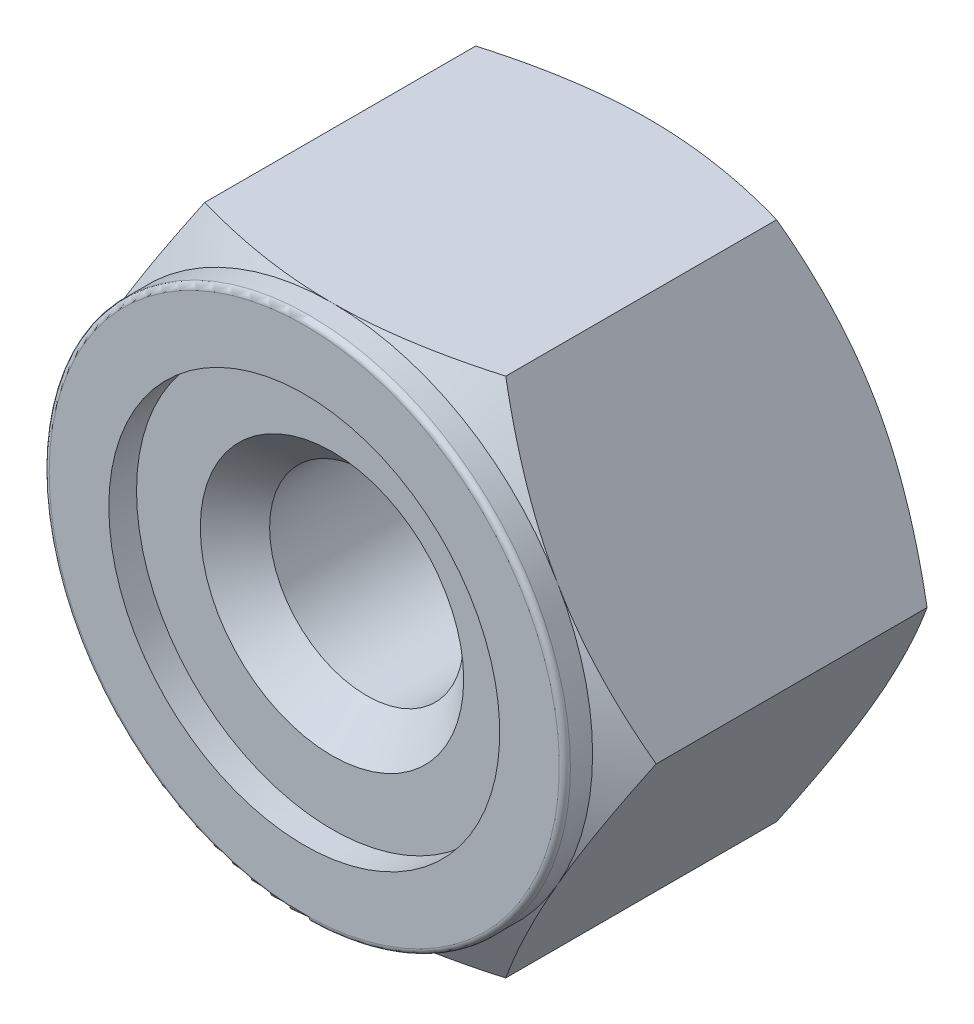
ISO-10303-21;
HEADER;
FILE_DESCRIPTION(('STEP AP214'),'2;1');
FILE_NAME('part.step','',(''),(''),'','','');
FILE_SCHEMA(('AUTOMOTIVE_DESIGN { 1 0 10303 214 1 1 1 1 }'));
ENDSEC;
DATA;
#1=APPLICATION_CONTEXT('core data for automotive mechanical design processes');
#2=APPLICATION_PROTOCOL_DEFINITION('international standard','automotive_design',2000,#1);
#3=PRODUCT_CONTEXT('',#1,'mechanical');
#4=PRODUCT('Part','Part','',(#3));
#5=PRODUCT_RELATED_PRODUCT_CATEGORY('part','',(#4));
#6=PRODUCT_DEFINITION_FORMATION('','',#4);
#7=PRODUCT_DEFINITION_CONTEXT('part definition',#1,'design');
#8=PRODUCT_DEFINITION('design','',#6,#7);
#9=PRODUCT_DEFINITION_SHAPE('','',#8);
#10=(LENGTH_UNIT() NAMED_UNIT(*) SI_UNIT(.MILLI.,.METRE.));
#11=(NAMED_UNIT(*) PLANE_ANGLE_UNIT() SI_UNIT($,.RADIAN.));
#12=(NAMED_UNIT(*) SI_UNIT($,.STERADIAN.) SOLID_ANGLE_UNIT());
#13=UNCERTAINTY_MEASURE_WITH_UNIT(LENGTH_MEASURE(1.E-05),#10,'distance_accuracy_value','');
#14=(GEOMETRIC_REPRESENTATION_CONTEXT(3) GLOBAL_UNCERTAINTY_ASSIGNED_CONTEXT((#13)) GLOBAL_UNIT_ASSIGNED_CONTEXT((#10,
#11,#12)) REPRESENTATION_CONTEXT('',''));
#15=CARTESIAN_POINT('',(0.,0.,0.));
#16=DIRECTION('',(0.,0.,1.));
#17=DIRECTION('',(1.,0.,0.));
#18=AXIS2_PLACEMENT_3D('',#15,#16,#17);
#19=CARTESIAN_POINT('',(0.,0.,-2.9083));
#20=DIRECTION('',(0.,0.,-1.));
#21=DIRECTION('',(-1.,0.,0.));
#22=AXIS2_PLACEMENT_3D('',#19,#20,#21);
#23=CONICAL_SURFACE('',#22,2.413,0.785398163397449);
#24=CARTESIAN_POINT('',(0.,0.,-2.9083));
#25=DIRECTION('',(0.,0.,1.));
#26=DIRECTION('',(1.,0.,0.));
#27=AXIS2_PLACEMENT_3D('',#24,#25,#26);
#28=CIRCLE('',#27,2.413);
#29=CARTESIAN_POINT('',(2.413,0.,-2.9083));
#30=VERTEX_POINT('',#29);
#31=EDGE_CURVE('E223',#30,#30,#28,.T.);
#32=ORIENTED_EDGE('',*,*,#31,.F.);
#33=EDGE_LOOP('',(#32));
#34=FACE_BOUND('',#33,.T.);
#35=CARTESIAN_POINT('',(0.,0.,-2.2733));
#36=DIRECTION('',(0.,0.,-1.));
#37=DIRECTION('',(1.,0.,0.));
#38=AXIS2_PLACEMENT_3D('',#35,#36,#37);
#39=CIRCLE('',#38,1.778);
#40=CARTESIAN_POINT('',(1.778,0.,-2.2733));
#41=VERTEX_POINT('',#40);
#42=EDGE_CURVE('E221',#41,#41,#39,.T.);
#43=ORIENTED_EDGE('',*,*,#42,.F.);
#44=EDGE_LOOP('',(#43));
#45=FACE_BOUND('',#44,.T.);
#46=ADVANCED_FACE('F17',(#34,#45),#23,.F.);
#47=CARTESIAN_POINT('',(0.,0.,2.2733));
#48=DIRECTION('',(0.,0.,1.));
#49=DIRECTION('',(1.,0.,0.));
#50=AXIS2_PLACEMENT_3D('',#47,#48,#49);
#51=CONICAL_SURFACE('',#50,1.778,0.785398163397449);
#52=CARTESIAN_POINT('',(0.,0.,2.2733));
#53=DIRECTION('',(0.,0.,1.));
#54=DIRECTION('',(1.,0.,0.));
#55=AXIS2_PLACEMENT_3D('',#52,#53,#54);
#56=CIRCLE('',#55,1.778);
#57=CARTESIAN_POINT('',(1.778,0.,2.2733));
#58=VERTEX_POINT('',#57);
#59=EDGE_CURVE('E218',#58,#58,#56,.T.);
#60=ORIENTED_EDGE('',*,*,#59,.F.);
#61=EDGE_LOOP('',(#60));
#62=FACE_BOUND('',#61,.T.);
#63=CARTESIAN_POINT('',(0.,0.,2.9083));
#64=DIRECTION('',(0.,0.,-1.));
#65=DIRECTION('',(1.,0.,0.));
#66=AXIS2_PLACEMENT_3D('',#63,#64,#65);
#67=CIRCLE('',#66,2.413);
#68=CARTESIAN_POINT('',(2.413,0.,2.9083));
#69=VERTEX_POINT('',#68);
#70=EDGE_CURVE('E232',#69,#69,#67,.T.);
#71=ORIENTED_EDGE('',*,*,#70,.F.);
#72=EDGE_LOOP('',(#71));
#73=FACE_BOUND('',#72,.T.);
#74=ADVANCED_FACE('F512',(#62,#73),#51,.F.);
#75=CARTESIAN_POINT('',(0.,0.,2.73018351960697));
#76=DIRECTION('',(0.,0.,-1.));
#77=DIRECTION('',(-1.,0.,0.));
#78=AXIS2_PLACEMENT_3D('',#75,#76,#77);
#79=CYLINDRICAL_SURFACE('',#78,3.5814);
#80=CARTESIAN_POINT('',(0.,0.,3.4163));
#81=DIRECTION('',(0.,0.,-1.));
#82=DIRECTION('',(-1.,0.,0.));
#83=AXIS2_PLACEMENT_3D('',#80,#81,#82);
#84=CIRCLE('',#83,3.5814);
#85=CARTESIAN_POINT('',(-3.5814,0.,3.4163));
#86=VERTEX_POINT('',#85);
#87=EDGE_CURVE('E11',#86,#86,#84,.T.);
#88=ORIENTED_EDGE('',*,*,#87,.F.);
#89=EDGE_LOOP('',(#88));
#90=FACE_BOUND('',#89,.T.);
#91=CARTESIAN_POINT('',(0.,0.,2.9083));
#92=DIRECTION('',(0.,0.,-1.));
#93=DIRECTION('',(1.,0.,0.));
#94=AXIS2_PLACEMENT_3D('',#91,#92,#93);
#95=CIRCLE('',#94,3.5814);
#96=CARTESIAN_POINT('',(3.5814,0.,2.9083));
#97=VERTEX_POINT('',#96);
#98=EDGE_CURVE('E228',#97,#97,#95,.T.);
#99=ORIENTED_EDGE('',*,*,#98,.T.);
#100=EDGE_LOOP('',(#99));
#101=FACE_BOUND('',#100,.T.);
#102=ADVANCED_FACE('F777',(#90,#101),#79,.F.);
#103=CARTESIAN_POINT('',(4.1275,0.,3.4163));
#104=DIRECTION('',(0.,0.,1.));
#105=DIRECTION('',(1.,0.,0.));
#106=AXIS2_PLACEMENT_3D('',#103,#104,#105);
#107=PLANE('',#106);
#108=CARTESIAN_POINT('',(0.,0.,3.4163));
#109=DIRECTION('',(0.,0.,-1.));
#110=DIRECTION('',(-1.,0.,0.));
#111=AXIS2_PLACEMENT_3D('',#108,#109,#110);
#112=CIRCLE('',#111,4.6736);
#113=CARTESIAN_POINT('',(-4.6736,0.,3.4163));
#114=VERTEX_POINT('',#113);
#115=EDGE_CURVE('E28',#114,#114,#112,.T.);
#116=ORIENTED_EDGE('',*,*,#115,.F.);
#117=EDGE_LOOP('',(#116));
#118=FACE_BOUND('',#117,.T.);
#119=ORIENTED_EDGE('',*,*,#87,.T.);
#120=EDGE_LOOP('',(#119));
#121=FACE_BOUND('',#120,.T.);
#122=ADVANCED_FACE('F769',(#118,#121),#107,.T.);
#123=CARTESIAN_POINT('',(0.,0.,3.3147));
#124=DIRECTION('',(0.,0.,-1.));
#125=DIRECTION('',(-1.,0.,0.));
#126=AXIS2_PLACEMENT_3D('',#123,#124,#125);
#127=TOROIDAL_SURFACE('',#126,4.6736,0.1016);
#128=CARTESIAN_POINT('',(0.,0.,3.3147));
#129=DIRECTION('',(0.,0.,-1.));
#130=DIRECTION('',(-1.,0.,0.));
#131=AXIS2_PLACEMENT_3D('',#128,#129,#130);
#132=CIRCLE('',#131,4.7752);
#133=CARTESIAN_POINT('',(-4.7752,0.,3.3147));
#134=VERTEX_POINT('',#133);
#135=EDGE_CURVE('E160',#134,#134,#132,.T.);
#136=ORIENTED_EDGE('',*,*,#135,.F.);
#137=EDGE_LOOP('',(#136));
#138=FACE_BOUND('',#137,.T.);
#139=ORIENTED_EDGE('',*,*,#115,.T.);
#140=EDGE_LOOP('',(#139));
#141=FACE_BOUND('',#140,.T.);
#142=ADVANCED_FACE('F762',(#138,#141),#127,.T.);
#143=CARTESIAN_POINT('',(0.,0.,2.73018351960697));
#144=DIRECTION('',(0.,0.,-1.));
#145=DIRECTION('',(-1.,0.,0.));
#146=AXIS2_PLACEMENT_3D('',#143,#144,#145);
#147=CYLINDRICAL_SURFACE('',#146,4.7752);
#148=ORIENTED_EDGE('',*,*,#135,.T.);
#149=EDGE_LOOP('',(#148));
#150=FACE_BOUND('',#149,.T.);
#151=CARTESIAN_POINT('',(0.,0.,2.9083));
#152=DIRECTION('',(0.,0.,1.));
#153=DIRECTION('',(1.,0.,0.));
#154=AXIS2_PLACEMENT_3D('',#151,#152,#153);
#155=CIRCLE('',#154,4.7752);
#156=CARTESIAN_POINT('',(4.13544450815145,-2.3876,2.9083));
#157=VERTEX_POINT('',#156);
#158=CARTESIAN_POINT('',(4.13544450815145,2.3876,2.9083));
#159=VERTEX_POINT('',#158);
#160=EDGE_CURVE('E276',#157,#159,#155,.T.);
#161=ORIENTED_EDGE('',*,*,#160,.T.);
#162=CARTESIAN_POINT('',(0.,0.,2.9083));
#163=DIRECTION('',(0.,0.,1.));
#164=DIRECTION('',(1.,0.,0.));
#165=AXIS2_PLACEMENT_3D('',#162,#163,#164);
#166=CIRCLE('',#165,4.7752);
#167=CARTESIAN_POINT('',(0.,4.7752,2.9083));
#168=VERTEX_POINT('',#167);
#169=EDGE_CURVE('E175',#159,#168,#166,.T.);
#170=ORIENTED_EDGE('',*,*,#169,.T.);
#171=CARTESIAN_POINT('',(0.,0.,2.9083));
#172=DIRECTION('',(0.,0.,1.));
#173=DIRECTION('',(1.,0.,0.));
#174=AXIS2_PLACEMENT_3D('',#171,#172,#173);
#175=CIRCLE('',#174,4.7752);
#176=CARTESIAN_POINT('',(-4.13544450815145,2.3876,2.9083));
#177=VERTEX_POINT('',#176);
#178=EDGE_CURVE('E428',#168,#177,#175,.T.);
#179=ORIENTED_EDGE('',*,*,#178,.T.);
#180=CARTESIAN_POINT('',(0.,0.,2.9083));
#181=DIRECTION('',(0.,0.,1.));
#182=DIRECTION('',(1.,0.,0.));
#183=AXIS2_PLACEMENT_3D('',#180,#181,#182);
#184=CIRCLE('',#183,4.7752);
#185=CARTESIAN_POINT('',(-4.13544450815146,-2.3876,2.9083));
#186=VERTEX_POINT('',#185);
#187=EDGE_CURVE('E454',#177,#186,#184,.T.);
#188=ORIENTED_EDGE('',*,*,#187,.T.);
#189=CARTESIAN_POINT('',(0.,0.,2.9083));
#190=DIRECTION('',(0.,0.,1.));
#191=DIRECTION('',(1.,0.,0.));
#192=AXIS2_PLACEMENT_3D('',#189,#190,#191);
#193=CIRCLE('',#192,4.7752);
#194=CARTESIAN_POINT('',(0.,-4.7752,2.9083));
#195=VERTEX_POINT('',#194);
#196=EDGE_CURVE('E730',#186,#195,#193,.T.);
#197=ORIENTED_EDGE('',*,*,#196,.T.);
#198=CARTESIAN_POINT('',(0.,0.,2.9083));
#199=DIRECTION('',(0.,0.,1.));
#200=DIRECTION('',(1.,0.,0.));
#201=AXIS2_PLACEMENT_3D('',#198,#199,#200);
#202=CIRCLE('',#201,4.7752);
#203=EDGE_CURVE('E653',#195,#157,#202,.T.);
#204=ORIENTED_EDGE('',*,*,#203,.T.);
#205=EDGE_LOOP('',(#161,#170,#179,#188,#197,#204));
#206=FACE_BOUND('',#205,.T.);
#207=ADVANCED_FACE('F309',(#150,#206),#147,.T.);
#208=CARTESIAN_POINT('',(4.13544450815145,2.3876,2.9083));
#209=DIRECTION('',(-0.866025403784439,-0.5,0.));
#210=DIRECTION('',(-0.5,0.866025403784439,0.));
#211=AXIS2_PLACEMENT_3D('',#208,#209,#210);
#212=PLANE('',#211);
#213=CARTESIAN_POINT('',(5.51392601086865,0.,-2.48179633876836));
#214=CARTESIAN_POINT('',(4.77520000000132,1.2795109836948,-2.9083));
#215=CARTESIAN_POINT('',(4.13544450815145,2.3876,-2.9083));
#216=B_SPLINE_CURVE_WITH_KNOTS('',2,(#213,#214,#215),.UNSPECIFIED.,.F.,.F.,(3,3),(0.,1.),.UNSPECIFIED.);
#217=CARTESIAN_POINT('',(5.5139260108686,0.,-2.48179633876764));
#218=VERTEX_POINT('',#217);
#219=CARTESIAN_POINT('',(4.13544450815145,2.3876,-2.9083));
#220=VERTEX_POINT('',#219);
#221=EDGE_CURVE('E245',#218,#220,#216,.T.);
#222=ORIENTED_EDGE('',*,*,#221,.T.);
#223=CARTESIAN_POINT('',(4.13544450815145,2.3876,-2.9083));
#224=CARTESIAN_POINT('',(3.49568901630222,3.49568901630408,-2.9083));
#225=CARTESIAN_POINT('',(2.75696300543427,4.77520000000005,-2.48179633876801));
#226=B_SPLINE_CURVE_WITH_KNOTS('',2,(#223,#224,#225),.UNSPECIFIED.,.F.,.F.,(3,3),(0.,1.),.UNSPECIFIED.);
#227=CARTESIAN_POINT('',(2.7569630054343,4.7752,-2.48179633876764));
#228=VERTEX_POINT('',#227);
#229=EDGE_CURVE('E155',#220,#228,#226,.T.);
#230=ORIENTED_EDGE('',*,*,#229,.T.);
#231=DIRECTION('',(0.,0.,-1.));
#232=VECTOR('',#231,1.);
#233=CARTESIAN_POINT('',(2.7569630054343,4.7752,2.9083));
#234=LINE('',#233,#232);
#235=CARTESIAN_POINT('',(2.7569630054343,4.7752,2.48179633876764));
#236=VERTEX_POINT('',#235);
#237=EDGE_CURVE('E146',#236,#228,#234,.T.);
#238=ORIENTED_EDGE('',*,*,#237,.F.);
#239=CARTESIAN_POINT('',(4.13544450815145,2.3876,2.9083));
#240=CARTESIAN_POINT('',(4.07756216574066,2.48778284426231,2.90834034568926));
#241=CARTESIAN_POINT('',(4.01965640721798,2.58795026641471,2.9059307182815));
#242=CARTESIAN_POINT('',(3.9041570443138,2.78784481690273,2.89630466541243));
#243=CARTESIAN_POINT('',(3.8465630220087,2.88757237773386,2.88910226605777));
#244=CARTESIAN_POINT('',(3.73119763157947,3.08764561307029,2.86989836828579));
#245=CARTESIAN_POINT('',(3.67342921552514,3.18798893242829,2.85785490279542));
#246=CARTESIAN_POINT('',(3.55699660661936,3.39017162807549,2.82905379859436));
#247=CARTESIAN_POINT('',(3.49833742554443,3.49200110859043,2.81220723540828));
#248=CARTESIAN_POINT('',(3.3836471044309,3.69067272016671,2.77513464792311));
#249=CARTESIAN_POINT('',(3.32760968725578,3.7875437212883,2.75508157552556));
#250=CARTESIAN_POINT('',(3.21514975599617,3.98200706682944,2.71104283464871));
#251=CARTESIAN_POINT('',(3.15873251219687,4.07959106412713,2.6870069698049));
#252=CARTESIAN_POINT('',(3.04520418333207,4.2760400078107,2.63504178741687));
#253=CARTESIAN_POINT('',(2.98810163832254,4.37489179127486,2.60704449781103));
#254=CARTESIAN_POINT('',(2.87290625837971,4.57436404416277,2.54716686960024));
#255=CARTESIAN_POINT('',(2.81482432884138,4.67496699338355,2.51520698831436));
#256=CARTESIAN_POINT('',(2.75696300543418,4.7751999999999,2.48179633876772));
#257=B_SPLINE_CURVE_WITH_KNOTS('',3,(#239,#240,#241,#242,#243,#244,#245,#246,#247,#248,#249,
#250,#251,#252,#253,#254,#255,#256),.UNSPECIFIED.,.F.,.F.,(4,2,2,2,2,2,2,2,4),(0.,
0.347077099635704,0.693142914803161,1.04227579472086,1.39834667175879,1.73936632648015,
2.08506637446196,2.43764712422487,2.79903739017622),.UNSPECIFIED.);
#258=EDGE_CURVE('E152',#159,#236,#257,.T.);
#259=ORIENTED_EDGE('',*,*,#258,.F.);
#260=CARTESIAN_POINT('',(5.51392601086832,0.,2.4817963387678));
#261=CARTESIAN_POINT('',(5.45605050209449,0.100229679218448,2.5152079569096));
#262=CARTESIAN_POINT('',(5.39795938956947,0.200831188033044,2.54717206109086));
#263=CARTESIAN_POINT('',(5.28280118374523,0.400301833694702,2.60705512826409));
#264=CARTESIAN_POINT('',(5.22574404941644,0.499152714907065,2.63505425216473));
#265=CARTESIAN_POINT('',(5.11238967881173,0.695617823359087,2.68701990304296));
#266=CARTESIAN_POINT('',(5.05609968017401,0.793217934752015,2.71105513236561));
#267=CARTESIAN_POINT('',(4.94395696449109,0.987720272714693,2.75509050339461));
#268=CARTESIAN_POINT('',(4.88810889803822,1.08461360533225,2.7751416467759));
#269=CARTESIAN_POINT('',(4.77344829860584,1.28316639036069,2.8122131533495));
#270=CARTESIAN_POINT('',(4.71461434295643,1.38484624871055,2.8290591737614));
#271=CARTESIAN_POINT('',(4.59776950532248,1.58675381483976,2.85785997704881));
#272=CARTESIAN_POINT('',(4.53976430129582,1.68697227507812,2.86990184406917));
#273=CARTESIAN_POINT('',(4.42417476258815,1.8869997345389,2.88910498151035));
#274=CARTESIAN_POINT('',(4.36659094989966,1.98680518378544,2.89630609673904));
#275=CARTESIAN_POINT('',(4.25116436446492,2.18694597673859,2.90593191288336));
#276=CARTESIAN_POINT('',(4.19332137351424,2.28728197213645,2.90834041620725));
#277=CARTESIAN_POINT('',(4.13544450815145,2.3876,2.9083));
#278=B_SPLINE_CURVE_WITH_KNOTS('',3,(#260,#261,#262,#263,#264,#265,#266,#267,#268,#269,#270,
#271,#272,#273,#274,#275,#276,#277),.UNSPECIFIED.,.F.,.F.,(4,2,2,2,2,2,2,2,4),(0.,
0.361403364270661,0.71391710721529,1.05947111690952,1.40026726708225,1.75621233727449,
2.10537501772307,2.45162730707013,2.79904785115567),.UNSPECIFIED.);
#279=CARTESIAN_POINT('',(5.5139260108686,0.,2.48179633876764));
#280=VERTEX_POINT('',#279);
#281=EDGE_CURVE('E268',#280,#159,#278,.T.);
#282=ORIENTED_EDGE('',*,*,#281,.F.);
#283=DIRECTION('',(0.,0.,-1.));
#284=VECTOR('',#283,1.);
#285=CARTESIAN_POINT('',(5.5139260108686,0.,2.9083));
#286=LINE('',#285,#284);
#287=EDGE_CURVE('E404',#280,#218,#286,.T.);
#288=ORIENTED_EDGE('',*,*,#287,.T.);
#289=EDGE_LOOP('',(#222,#230,#238,#259,#282,#288));
#290=FACE_BOUND('',#289,.T.);
#291=ADVANCED_FACE('F149',(#290),#212,.F.);
#292=CARTESIAN_POINT('',(0.,4.7752,2.9083));
#293=DIRECTION('',(0.,-1.,0.));
#294=DIRECTION('',(0.,0.,-1.));
#295=AXIS2_PLACEMENT_3D('',#292,#293,#294);
#296=PLANE('',#295);
#297=CARTESIAN_POINT('',(2.7569630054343,4.7752,-2.48179633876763));
#298=CARTESIAN_POINT('',(1.2795109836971,4.7752,-2.9083));
#299=CARTESIAN_POINT('',(0.,4.7752,-2.9083));
#300=B_SPLINE_CURVE_WITH_KNOTS('',2,(#297,#298,#299),.UNSPECIFIED.,.F.,.F.,(3,3),(0.,1.),.UNSPECIFIED.);
#301=CARTESIAN_POINT('',(0.,4.7752,-2.9083));
#302=VERTEX_POINT('',#301);
#303=EDGE_CURVE('E430',#228,#302,#300,.T.);
#304=ORIENTED_EDGE('',*,*,#303,.T.);
#305=CARTESIAN_POINT('',(0.,4.7752,-2.9083));
#306=CARTESIAN_POINT('',(-1.27951098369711,4.7752,-2.9083));
#307=CARTESIAN_POINT('',(-2.75696300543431,4.7752,-2.48179633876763));
#308=B_SPLINE_CURVE_WITH_KNOTS('',2,(#305,#306,#307),.UNSPECIFIED.,.F.,.F.,(3,3),(0.,1.),.UNSPECIFIED.);
#309=CARTESIAN_POINT('',(-2.7569630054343,4.7752,-2.48179633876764));
#310=VERTEX_POINT('',#309);
#311=EDGE_CURVE('E444',#302,#310,#308,.T.);
#312=ORIENTED_EDGE('',*,*,#311,.T.);
#313=DIRECTION('',(0.,0.,-1.));
#314=VECTOR('',#313,1.);
#315=CARTESIAN_POINT('',(-2.7569630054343,4.7752,2.9083));
#316=LINE('',#315,#314);
#317=CARTESIAN_POINT('',(-2.7569630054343,4.7752,2.48179633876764));
#318=VERTEX_POINT('',#317);
#319=EDGE_CURVE('E161',#318,#310,#316,.T.);
#320=ORIENTED_EDGE('',*,*,#319,.F.);
#321=CARTESIAN_POINT('',(0.,4.7752,2.9083));
#322=CARTESIAN_POINT('',(-0.116091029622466,4.77516358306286,2.90834073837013));
#323=CARTESIAN_POINT('',(-0.232180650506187,4.77508885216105,2.90592064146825));
#324=CARTESIAN_POINT('',(-0.463771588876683,4.77498056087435,2.89624893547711));
#325=CARTESIAN_POINT('',(-0.579273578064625,4.77494686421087,2.88901344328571));
#326=CARTESIAN_POINT('',(-0.810858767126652,4.77503701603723,2.86971876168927));
#327=CARTESIAN_POINT('',(-0.926938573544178,4.77516220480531,2.85761913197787));
#328=CARTESIAN_POINT('',(-1.1608063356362,4.77539594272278,2.82868166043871));
#329=CARTESIAN_POINT('',(-1.27858330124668,4.77550411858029,2.81175578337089));
#330=CARTESIAN_POINT('',(-1.50786909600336,4.77551963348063,2.77460382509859));
#331=CARTESIAN_POINT('',(-1.61940976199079,4.775436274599,2.75457285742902));
#332=CARTESIAN_POINT('',(-1.84334423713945,4.77530332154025,2.71059468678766));
#333=CARTESIAN_POINT('',(-1.95572798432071,4.77525421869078,2.68659637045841));
#334=CARTESIAN_POINT('',(-2.18198380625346,4.77519461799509,2.63472205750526));
#335=CARTESIAN_POINT('',(-2.29584005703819,4.77518492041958,2.60677749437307));
#336=CARTESIAN_POINT('',(-2.52560819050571,4.77518395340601,2.54702060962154));
#337=CARTESIAN_POINT('',(-2.64149935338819,4.77519315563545,2.51512842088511));
#338=CARTESIAN_POINT('',(-2.75696300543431,4.7752,2.48179633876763));
#339=B_SPLINE_CURVE_WITH_KNOTS('',3,(#321,#322,#323,#324,#325,#326,#327,#328,#329,#330,#331,
#332,#333,#334,#335,#336,#337,#338),.UNSPECIFIED.,.F.,.F.,(4,2,2,2,2,2,2,2,4),(0.,
0.348244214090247,0.695328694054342,1.04536056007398,1.40223782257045,1.74215143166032,
2.08684532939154,2.43850555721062,2.79904844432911),.UNSPECIFIED.);
#340=EDGE_CURVE('E169',#168,#318,#339,.T.);
#341=ORIENTED_EDGE('',*,*,#340,.F.);
#342=CARTESIAN_POINT('',(2.7569630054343,4.7752,2.48179633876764));
#343=CARTESIAN_POINT('',(2.64147677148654,4.77519327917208,2.51513486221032));
#344=CARTESIAN_POINT('',(2.52556301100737,4.7751830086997,2.54703350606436));
#345=CARTESIAN_POINT('',(2.29575235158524,4.77518019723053,2.6068020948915));
#346=CARTESIAN_POINT('',(2.18187619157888,4.77518722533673,2.63475198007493));
#347=CARTESIAN_POINT('',(1.95558297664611,4.77524058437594,2.68663556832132));
#348=CARTESIAN_POINT('',(1.84318176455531,4.7752861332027,2.71063791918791));
#349=CARTESIAN_POINT('',(1.61921466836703,4.77540990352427,2.75462363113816));
#350=CARTESIAN_POINT('',(1.50765886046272,4.77548766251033,2.77465817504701));
#351=CARTESIAN_POINT('',(1.27840601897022,4.77546484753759,2.81180355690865));
#352=CARTESIAN_POINT('',(1.16067749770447,4.77535528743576,2.828721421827));
#353=CARTESIAN_POINT('',(0.926886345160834,4.77512571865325,2.85764520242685));
#354=CARTESIAN_POINT('',(0.810834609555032,4.77500594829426,2.8697384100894));
#355=CARTESIAN_POINT('',(0.579286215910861,4.77492746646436,2.88902358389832));
#356=CARTESIAN_POINT('',(0.463792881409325,4.77496743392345,2.89625517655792));
#357=CARTESIAN_POINT('',(0.232200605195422,4.77508541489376,2.90592220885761));
#358=CARTESIAN_POINT('',(0.116100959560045,4.77516356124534,2.90834075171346));
#359=CARTESIAN_POINT('',(0.,4.7752,2.9083));
#360=B_SPLINE_CURVE_WITH_KNOTS('',3,(#342,#343,#344,#345,#346,#347,#348,#349,#350,#351,#352,
#353,#354,#355,#356,#357,#358,#359),.UNSPECIFIED.,.F.,.F.,(4,2,2,2,2,2,2,2,4),(0.,
0.36061336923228,0.712335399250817,1.05708306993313,1.39704323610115,1.75377319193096,
2.10371923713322,2.45077715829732,2.79905133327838),.UNSPECIFIED.);
#361=EDGE_CURVE('E165',#236,#168,#360,.T.);
#362=ORIENTED_EDGE('',*,*,#361,.F.);
#363=ORIENTED_EDGE('',*,*,#237,.T.);
#364=EDGE_LOOP('',(#304,#312,#320,#341,#362,#363));
#365=FACE_BOUND('',#364,.T.);
#366=ADVANCED_FACE('F167',(#365),#296,.F.);
#367=CARTESIAN_POINT('',(-4.13544450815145,2.3876,2.9083));
#368=DIRECTION('',(0.866025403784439,-0.5,0.));
#369=DIRECTION('',(0.,0.,-1.));
#370=AXIS2_PLACEMENT_3D('',#367,#368,#369);
#371=PLANE('',#370);
#372=CARTESIAN_POINT('',(-2.75696300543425,4.77520000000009,-2.48179633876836));
#373=CARTESIAN_POINT('',(-3.49568901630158,3.4956890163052,-2.9083));
#374=CARTESIAN_POINT('',(-4.13544450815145,2.3876,-2.9083));
#375=B_SPLINE_CURVE_WITH_KNOTS('',2,(#372,#373,#374),.UNSPECIFIED.,.F.,.F.,(3,3),(0.,1.),.UNSPECIFIED.);
#376=CARTESIAN_POINT('',(-4.13544450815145,2.3876,-2.9083));
#377=VERTEX_POINT('',#376);
#378=EDGE_CURVE('E448',#310,#377,#375,.T.);
#379=ORIENTED_EDGE('',*,*,#378,.T.);
#380=CARTESIAN_POINT('',(-4.13544450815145,2.3876,-2.9083));
#381=CARTESIAN_POINT('',(-4.77520000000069,1.2795109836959,-2.9083));
#382=CARTESIAN_POINT('',(-5.51392601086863,0.,-2.481796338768));
#383=B_SPLINE_CURVE_WITH_KNOTS('',2,(#380,#381,#382),.UNSPECIFIED.,.F.,.F.,(3,3),(0.,1.),.UNSPECIFIED.);
#384=CARTESIAN_POINT('',(-5.5139260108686,0.,-2.48179633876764));
#385=VERTEX_POINT('',#384);
#386=EDGE_CURVE('E532',#377,#385,#383,.T.);
#387=ORIENTED_EDGE('',*,*,#386,.T.);
#388=DIRECTION('',(0.,0.,-1.));
#389=VECTOR('',#388,1.);
#390=CARTESIAN_POINT('',(-5.51392601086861,0.,2.9083));
#391=LINE('',#390,#389);
#392=CARTESIAN_POINT('',(-5.5139260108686,0.,2.48179633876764));
#393=VERTEX_POINT('',#392);
#394=EDGE_CURVE('E718',#393,#385,#391,.T.);
#395=ORIENTED_EDGE('',*,*,#394,.F.);
#396=CARTESIAN_POINT('',(-4.13544450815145,2.3876,2.9083));
#397=CARTESIAN_POINT('',(-4.19326422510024,2.28738099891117,2.90834034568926));
#398=CARTESIAN_POINT('',(-4.25105887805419,2.18714942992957,2.90593071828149));
#399=CARTESIAN_POINT('',(-4.36642295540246,1.98717677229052,2.89630466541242));
#400=CARTESIAN_POINT('',(-4.4239925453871,1.88743510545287,2.88910226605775));
#401=CARTESIAN_POINT('',(-4.53957835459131,1.6874891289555,2.86989836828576));
#402=CARTESIAN_POINT('',(-4.59759401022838,1.58728855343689,2.85785490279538));
#403=CARTESIAN_POINT('',(-4.71447305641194,1.38536360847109,2.82905379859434));
#404=CARTESIAN_POINT('',(-4.77333038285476,1.28364852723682,2.81220723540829));
#405=CARTESIAN_POINT('',(-4.88803988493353,1.08498798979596,2.77513464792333));
#406=CARTESIAN_POINT('',(-4.94391392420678,0.988022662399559,2.75508157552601));
#407=CARTESIAN_POINT('',(-5.05609415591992,0.793397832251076,2.71104283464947));
#408=CARTESIAN_POINT('',(-5.11239575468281,0.695747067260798,2.68700696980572));
#409=CARTESIAN_POINT('',(-5.2257613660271,0.499204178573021,2.63504178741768));
#410=CARTESIAN_POINT('',(-5.28281824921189,0.400326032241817,2.60704449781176));
#411=CARTESIAN_POINT('',(-5.39796859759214,0.200827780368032,2.54716686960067));
#412=CARTESIAN_POINT('',(-5.45605234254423,0.100225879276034,2.51520698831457));
#413=CARTESIAN_POINT('',(-5.51392601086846,0.,2.48179633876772));
#414=B_SPLINE_CURVE_WITH_KNOTS('',3,(#396,#397,#398,#399,#400,#401,#402,#403,#404,#405,#406,
#407,#408,#409,#410,#411,#412,#413),.UNSPECIFIED.,.F.,.F.,(4,2,2,2,2,2,2,2,4),(0.,
0.347077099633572,0.693142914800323,1.04227579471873,1.39834667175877,1.73936632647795,
2.08506637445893,2.43764712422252,2.79903739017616),.UNSPECIFIED.);
#415=EDGE_CURVE('E464',#177,#393,#414,.T.);
#416=ORIENTED_EDGE('',*,*,#415,.F.);
#417=CARTESIAN_POINT('',(-2.75696300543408,4.77519999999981,2.48179633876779));
#418=CARTESIAN_POINT('',(-2.81482669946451,4.67496349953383,2.51520795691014));
#419=CARTESIAN_POINT('',(-2.87290460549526,4.57435436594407,2.54717206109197));
#420=CARTESIAN_POINT('',(-2.98807214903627,4.37488911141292,2.60705512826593));
#421=CARTESIAN_POINT('',(-3.04515095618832,4.27605074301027,2.63505425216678));
#422=CARTESIAN_POINT('',(-3.15861754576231,4.07965042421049,2.68701990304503));
#423=CARTESIAN_POINT('',(-3.21499672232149,3.98210179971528,2.71105513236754));
#424=CARTESIAN_POINT('',(-3.32736933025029,3.78773219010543,2.75509050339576));
#425=CARTESIAN_POINT('',(-3.38335738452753,3.69091967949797,2.77514164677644));
#426=CARTESIAN_POINT('',(-3.49797884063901,3.49234429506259,2.81221315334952));
#427=CARTESIAN_POINT('',(-3.55661920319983,3.39055266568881,2.82905917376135));
#428=CARTESIAN_POINT('',(-3.67305386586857,3.18840828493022,2.85785997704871));
#429=CARTESIAN_POINT('',(-3.73084299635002,3.08806507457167,2.86990184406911));
#430=CARTESIAN_POINT('',(-3.84627708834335,2.88794786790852,2.8891049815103));
#431=CARTESIAN_POINT('',(-3.90391923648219,2.78817609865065,2.89630609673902));
#432=CARTESIAN_POINT('',(-4.01953295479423,2.58814334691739,2.90593191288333));
#433=CARTESIAN_POINT('',(-4.07750498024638,2.48788184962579,2.90834041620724));
#434=CARTESIAN_POINT('',(-4.13544450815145,2.3876,2.9083));
#435=B_SPLINE_CURVE_WITH_KNOTS('',3,(#417,#418,#419,#420,#421,#422,#423,#424,#425,#426,#427,
#428,#429,#430,#431,#432,#433,#434),.UNSPECIFIED.,.F.,.F.,(4,2,2,2,2,2,2,2,4),(0.,
0.361403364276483,0.713917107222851,1.05947111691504,1.40026726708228,1.75621233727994,
2.10537501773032,2.45162730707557,2.79904785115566),.UNSPECIFIED.);
#436=EDGE_CURVE('E431',#318,#177,#435,.T.);
#437=ORIENTED_EDGE('',*,*,#436,.F.);
#438=ORIENTED_EDGE('',*,*,#319,.T.);
#439=EDGE_LOOP('',(#379,#387,#395,#416,#437,#438));
#440=FACE_BOUND('',#439,.T.);
#441=ADVANCED_FACE('F504',(#440),#371,.F.);
#442=CARTESIAN_POINT('',(-4.13544450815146,-2.3876,2.9083));
#443=DIRECTION('',(0.866025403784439,0.5,0.));
#444=DIRECTION('',(0.,0.,-1.));
#445=AXIS2_PLACEMENT_3D('',#442,#443,#444);
#446=PLANE('',#445);
#447=CARTESIAN_POINT('',(-5.51392601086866,0.,-2.48179633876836));
#448=CARTESIAN_POINT('',(-4.77520000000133,-1.27951098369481,-2.9083));
#449=CARTESIAN_POINT('',(-4.13544450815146,-2.3876,-2.9083));
#450=B_SPLINE_CURVE_WITH_KNOTS('',2,(#447,#448,#449),.UNSPECIFIED.,.F.,.F.,(3,3),(0.,1.),.UNSPECIFIED.);
#451=CARTESIAN_POINT('',(-4.13544450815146,-2.3876,-2.9083));
#452=VERTEX_POINT('',#451);
#453=EDGE_CURVE('E557',#385,#452,#450,.T.);
#454=ORIENTED_EDGE('',*,*,#453,.T.);
#455=CARTESIAN_POINT('',(-4.13544450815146,-2.3876,-2.9083));
#456=CARTESIAN_POINT('',(-3.49568901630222,-3.4956890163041,-2.9083));
#457=CARTESIAN_POINT('',(-2.75696300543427,-4.77520000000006,-2.481796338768));
#458=B_SPLINE_CURVE_WITH_KNOTS('',2,(#455,#456,#457),.UNSPECIFIED.,.F.,.F.,(3,3),(0.,1.),.UNSPECIFIED.);
#459=CARTESIAN_POINT('',(-2.7569630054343,-4.7752,-2.48179633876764));
#460=VERTEX_POINT('',#459);
#461=EDGE_CURVE('E630',#452,#460,#458,.T.);
#462=ORIENTED_EDGE('',*,*,#461,.T.);
#463=DIRECTION('',(0.,0.,-1.));
#464=VECTOR('',#463,1.);
#465=CARTESIAN_POINT('',(-2.7569630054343,-4.7752,2.9083));
#466=LINE('',#465,#464);
#467=CARTESIAN_POINT('',(-2.7569630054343,-4.7752,2.48179633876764));
#468=VERTEX_POINT('',#467);
#469=EDGE_CURVE('E418',#468,#460,#466,.T.);
#470=ORIENTED_EDGE('',*,*,#469,.F.);
#471=CARTESIAN_POINT('',(-4.13544450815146,-2.38759999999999,2.9083));
#472=CARTESIAN_POINT('',(-4.07756216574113,-2.48778284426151,2.90834034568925));
#473=CARTESIAN_POINT('',(-4.01965640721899,-2.58795026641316,2.90593071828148));
#474=CARTESIAN_POINT('',(-3.90415704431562,-2.78784481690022,2.89630466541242));
#475=CARTESIAN_POINT('',(-3.84656302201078,-2.88757237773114,2.88910226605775));
#476=CARTESIAN_POINT('',(-3.73119763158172,-3.08764561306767,2.86989836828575));
#477=CARTESIAN_POINT('',(-3.6734292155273,-3.18798893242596,2.85785490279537));
#478=CARTESIAN_POINT('',(-3.55699660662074,-3.39017162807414,2.82905379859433));
#479=CARTESIAN_POINT('',(-3.49833742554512,-3.49200110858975,2.81220723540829));
#480=CARTESIAN_POINT('',(-3.38364710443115,-3.69067272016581,2.77513464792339));
#481=CARTESIAN_POINT('',(-3.32760968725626,-3.78754372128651,2.75508157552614));
#482=CARTESIAN_POINT('',(-3.2151497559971,-3.9820070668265,2.71104283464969));
#483=CARTESIAN_POINT('',(-3.15873251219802,-4.07959106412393,2.68700696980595));
#484=CARTESIAN_POINT('',(-3.04520418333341,-4.27604000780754,2.63504178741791));
#485=CARTESIAN_POINT('',(-2.98810163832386,-4.37489179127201,2.60704449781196));
#486=CARTESIAN_POINT('',(-2.8729062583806,-4.57436404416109,2.5471668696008));
#487=CARTESIAN_POINT('',(-2.81482432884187,-4.67496699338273,2.51520698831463));
#488=CARTESIAN_POINT('',(-2.75696300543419,-4.77519999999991,2.48179633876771));
#489=B_SPLINE_CURVE_WITH_KNOTS('',3,(#471,#472,#473,#474,#475,#476,#477,#478,#479,#480,#481,
#482,#483,#484,#485,#486,#487,#488),.UNSPECIFIED.,.F.,.F.,(4,2,2,2,2,2,2,2,4),(0.,
0.347077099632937,0.693142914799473,1.04227579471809,1.39834667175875,1.73936632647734,
2.0850663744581,2.4376471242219,2.79903739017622),.UNSPECIFIED.);
#490=EDGE_CURVE('E620',#186,#468,#489,.T.);
#491=ORIENTED_EDGE('',*,*,#490,.F.);
#492=CARTESIAN_POINT('',(-5.51392601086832,0.,2.4817963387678));
#493=CARTESIAN_POINT('',(-5.45605050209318,-0.100229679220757,2.51520795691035));
#494=CARTESIAN_POINT('',(-5.39795938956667,-0.200831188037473,2.54717206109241));
#495=CARTESIAN_POINT('',(-5.28280118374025,-0.400301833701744,2.60705512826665));
#496=CARTESIAN_POINT('',(-5.22574404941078,-0.499152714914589,2.63505425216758));
#497=CARTESIAN_POINT('',(-5.11238967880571,-0.695617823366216,2.68701990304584));
#498=CARTESIAN_POINT('',(-5.05609968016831,-0.793217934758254,2.71105513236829));
#499=CARTESIAN_POINT('',(-4.94395696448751,-0.987720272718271,2.75509050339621));
#500=CARTESIAN_POINT('',(-4.88810889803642,-1.08461360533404,2.77514164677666));
#501=CARTESIAN_POINT('',(-4.77344829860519,-1.28316639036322,2.81221315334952));
#502=CARTESIAN_POINT('',(-4.71461434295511,-1.38484624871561,2.82905917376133));
#503=CARTESIAN_POINT('',(-4.59776950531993,-1.58675381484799,2.85785997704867));
#504=CARTESIAN_POINT('',(-4.53976430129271,-1.68697227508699,2.86990184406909));
#505=CARTESIAN_POINT('',(-4.42417476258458,-1.8869997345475,2.88910498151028));
#506=CARTESIAN_POINT('',(-4.3665909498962,-1.98680518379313,2.89630609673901));
#507=CARTESIAN_POINT('',(-4.25116436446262,-2.18694597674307,2.90593191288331));
#508=CARTESIAN_POINT('',(-4.193321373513,-2.28728197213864,2.90834041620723));
#509=CARTESIAN_POINT('',(-4.13544450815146,-2.38759999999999,2.9083));
#510=B_SPLINE_CURVE_WITH_KNOTS('',3,(#492,#493,#494,#495,#496,#497,#498,#499,#500,#501,#502,
#503,#504,#505,#506,#507,#508,#509),.UNSPECIFIED.,.F.,.F.,(4,2,2,2,2,2,2,2,4),(0.,
0.361403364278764,0.713917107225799,1.05947111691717,1.40026726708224,1.75621233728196,
2.10537501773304,2.45162730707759,2.79904785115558),.UNSPECIFIED.);
#511=EDGE_CURVE('E460',#393,#186,#510,.T.);
#512=ORIENTED_EDGE('',*,*,#511,.F.);
#513=ORIENTED_EDGE('',*,*,#394,.T.);
#514=EDGE_LOOP('',(#454,#462,#470,#491,#512,#513));
#515=FACE_BOUND('',#514,.T.);
#516=ADVANCED_FACE('F341',(#515),#446,.F.);
#517=CARTESIAN_POINT('',(0.,-4.7752,2.9083));
#518=DIRECTION('',(0.,1.,0.));
#519=DIRECTION('',(1.,0.,0.));
#520=AXIS2_PLACEMENT_3D('',#517,#518,#519);
#521=PLANE('',#520);
#522=CARTESIAN_POINT('',(-2.7569630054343,-4.7752,-2.48179633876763));
#523=CARTESIAN_POINT('',(-1.2795109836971,-4.7752,-2.9083));
#524=CARTESIAN_POINT('',(0.,-4.7752,-2.9083));
#525=B_SPLINE_CURVE_WITH_KNOTS('',2,(#522,#523,#524),.UNSPECIFIED.,.F.,.F.,(3,3),(0.,1.),.UNSPECIFIED.);
#526=CARTESIAN_POINT('',(0.,-4.7752,-2.9083));
#527=VERTEX_POINT('',#526);
#528=EDGE_CURVE('E649',#460,#527,#525,.T.);
#529=ORIENTED_EDGE('',*,*,#528,.T.);
#530=CARTESIAN_POINT('',(0.,-4.7752,-2.9083));
#531=CARTESIAN_POINT('',(1.27951098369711,-4.7752,-2.9083));
#532=CARTESIAN_POINT('',(2.75696300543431,-4.7752,-2.48179633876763));
#533=B_SPLINE_CURVE_WITH_KNOTS('',2,(#530,#531,#532),.UNSPECIFIED.,.F.,.F.,(3,3),(0.,1.),.UNSPECIFIED.);
#534=CARTESIAN_POINT('',(2.7569630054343,-4.7752,-2.48179633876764));
#535=VERTEX_POINT('',#534);
#536=EDGE_CURVE('E261',#527,#535,#533,.T.);
#537=ORIENTED_EDGE('',*,*,#536,.T.);
#538=DIRECTION('',(0.,0.,-1.));
#539=VECTOR('',#538,1.);
#540=CARTESIAN_POINT('',(2.7569630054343,-4.7752,2.9083));
#541=LINE('',#540,#539);
#542=CARTESIAN_POINT('',(2.7569630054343,-4.7752,2.48179633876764));
#543=VERTEX_POINT('',#542);
#544=EDGE_CURVE('E406',#543,#535,#541,.T.);
#545=ORIENTED_EDGE('',*,*,#544,.F.);
#546=CARTESIAN_POINT('',(0.,-4.7752,2.9083));
#547=CARTESIAN_POINT('',(0.116091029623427,-4.77516358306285,2.90834073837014));
#548=CARTESIAN_POINT('',(0.232180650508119,-4.77508885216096,2.90592064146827));
#549=CARTESIAN_POINT('',(0.463771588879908,-4.77498056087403,2.89624893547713));
#550=CARTESIAN_POINT('',(0.579273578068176,-4.77494686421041,2.88901344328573));
#551=CARTESIAN_POINT('',(0.810858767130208,-4.77503701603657,2.8697187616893));
#552=CARTESIAN_POINT('',(0.926938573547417,-4.77516220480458,2.85761913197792));
#553=CARTESIAN_POINT('',(1.16080633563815,-4.77539594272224,2.82868166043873));
#554=CARTESIAN_POINT('',(1.27858330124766,-4.77550411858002,2.81175578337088));
#555=CARTESIAN_POINT('',(1.50786909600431,-4.77551963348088,2.77460382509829));
#556=CARTESIAN_POINT('',(1.61940976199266,-4.7754362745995,2.75457285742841));
#557=CARTESIAN_POINT('',(1.8433442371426,-4.77530332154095,2.71059468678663));
#558=CARTESIAN_POINT('',(1.95572798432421,-4.77525421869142,2.68659637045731));
#559=CARTESIAN_POINT('',(2.18198380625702,-4.77519461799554,2.63472205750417));
#560=CARTESIAN_POINT('',(2.29584005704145,-4.7751849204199,2.60677749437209));
#561=CARTESIAN_POINT('',(2.52560819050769,-4.7751839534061,2.54702060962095));
#562=CARTESIAN_POINT('',(2.64149935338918,-4.77519315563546,2.51512842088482));
#563=CARTESIAN_POINT('',(2.75696300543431,-4.7752,2.48179633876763));
#564=B_SPLINE_CURVE_WITH_KNOTS('',3,(#546,#547,#548,#549,#550,#551,#552,#553,#554,#555,#556,
#557,#558,#559,#560,#561,#562,#563),.UNSPECIFIED.,.F.,.F.,(4,2,2,2,2,2,2,2,4),(0.,
0.348244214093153,0.695328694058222,1.0453605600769,1.4022378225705,1.74215143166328,
2.08684532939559,2.43850555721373,2.79904844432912),.UNSPECIFIED.);
#565=EDGE_CURVE('E289',#195,#543,#564,.T.);
#566=ORIENTED_EDGE('',*,*,#565,.F.);
#567=CARTESIAN_POINT('',(-2.75696300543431,-4.7752,2.48179633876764));
#568=CARTESIAN_POINT('',(-2.64147677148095,-4.77519327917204,2.51513486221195));
#569=CARTESIAN_POINT('',(-2.5255630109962,-4.77518300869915,2.54703350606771));
#570=CARTESIAN_POINT('',(-2.29575235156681,-4.77518019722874,2.60680209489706));
#571=CARTESIAN_POINT('',(-2.1818761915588,-4.7751872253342,2.6347519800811));
#572=CARTESIAN_POINT('',(-1.95558297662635,-4.77524058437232,2.68663556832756));
#573=CARTESIAN_POINT('',(-1.84318176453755,-4.77528613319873,2.71063791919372));
#574=CARTESIAN_POINT('',(-1.61921466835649,-4.7754099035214,2.75462363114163));
#575=CARTESIAN_POINT('',(-1.50765886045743,-4.77548766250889,2.77465817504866));
#576=CARTESIAN_POINT('',(-1.27840601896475,-4.7754648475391,2.8118035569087));
#577=CARTESIAN_POINT('',(-1.16067749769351,-4.77535528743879,2.82872142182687));
#578=CARTESIAN_POINT('',(-0.926886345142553,-4.77512571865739,2.85764520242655));
#579=CARTESIAN_POINT('',(-0.810834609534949,-4.77500594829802,2.86973841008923));
#580=CARTESIAN_POINT('',(-0.579286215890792,-4.77492746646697,2.88902358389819));
#581=CARTESIAN_POINT('',(-0.463792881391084,-4.77496743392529,2.89625517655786));
#582=CARTESIAN_POINT('',(-0.232200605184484,-4.77508541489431,2.90592220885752));
#583=CARTESIAN_POINT('',(-0.116100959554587,-4.77516356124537,2.90834075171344));
#584=CARTESIAN_POINT('',(0.,-4.7752,2.9083));
#585=B_SPLINE_CURVE_WITH_KNOTS('',3,(#567,#568,#569,#570,#571,#572,#573,#574,#575,#576,#577,
#578,#579,#580,#581,#582,#583,#584),.UNSPECIFIED.,.F.,.F.,(4,2,2,2,2,2,2,2,4),(0.,
0.360613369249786,0.712335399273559,1.05708306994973,1.39704323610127,1.75377319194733,
2.10371923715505,2.45077715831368,2.79905133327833),.UNSPECIFIED.);
#586=EDGE_CURVE('E590',#468,#195,#585,.T.);
#587=ORIENTED_EDGE('',*,*,#586,.F.);
#588=ORIENTED_EDGE('',*,*,#469,.T.);
#589=EDGE_LOOP('',(#529,#537,#545,#566,#587,#588));
#590=FACE_BOUND('',#589,.T.);
#591=ADVANCED_FACE('F332',(#590),#521,.F.);
#592=CARTESIAN_POINT('',(4.13544450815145,-2.3876,2.9083));
#593=DIRECTION('',(-0.866025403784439,0.5,0.));
#594=DIRECTION('',(0.,0.,1.));
#595=AXIS2_PLACEMENT_3D('',#592,#593,#594);
#596=PLANE('',#595);
#597=CARTESIAN_POINT('',(2.75696300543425,-4.77520000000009,-2.48179633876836));
#598=CARTESIAN_POINT('',(3.49568901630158,-3.4956890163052,-2.9083));
#599=CARTESIAN_POINT('',(4.13544450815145,-2.3876,-2.9083));
#600=B_SPLINE_CURVE_WITH_KNOTS('',2,(#597,#598,#599),.UNSPECIFIED.,.F.,.F.,(3,3),(0.,1.),.UNSPECIFIED.);
#601=CARTESIAN_POINT('',(4.13544450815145,-2.3876,-2.9083));
#602=VERTEX_POINT('',#601);
#603=EDGE_CURVE('E253',#535,#602,#600,.T.);
#604=ORIENTED_EDGE('',*,*,#603,.T.);
#605=CARTESIAN_POINT('',(4.13544450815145,-2.3876,-2.9083));
#606=CARTESIAN_POINT('',(4.77520000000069,-1.27951098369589,-2.9083));
#607=CARTESIAN_POINT('',(5.51392601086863,0.,-2.481796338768));
#608=B_SPLINE_CURVE_WITH_KNOTS('',2,(#605,#606,#607),.UNSPECIFIED.,.F.,.F.,(3,3),(0.,1.),.UNSPECIFIED.);
#609=EDGE_CURVE('E238',#602,#218,#608,.T.);
#610=ORIENTED_EDGE('',*,*,#609,.T.);
#611=ORIENTED_EDGE('',*,*,#287,.F.);
#612=CARTESIAN_POINT('',(4.13544450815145,-2.38759999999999,2.9083));
#613=CARTESIAN_POINT('',(4.19326422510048,-2.28738099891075,2.90834034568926));
#614=CARTESIAN_POINT('',(4.25105887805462,-2.18714942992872,2.9059307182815));
#615=CARTESIAN_POINT('',(4.36642295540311,-1.98717677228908,2.89630466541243));
#616=CARTESIAN_POINT('',(4.42399254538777,-1.88743510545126,2.88910226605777));
#617=CARTESIAN_POINT('',(4.53957835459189,-1.68748912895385,2.86989836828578));
#618=CARTESIAN_POINT('',(4.59759401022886,-1.58728855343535,2.85785490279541));
#619=CARTESIAN_POINT('',(4.71447305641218,-1.38536360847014,2.82905379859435));
#620=CARTESIAN_POINT('',(4.77333038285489,-1.28364852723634,2.81220723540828));
#621=CARTESIAN_POINT('',(4.88803988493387,-1.08498798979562,2.77513464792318));
#622=CARTESIAN_POINT('',(4.94391392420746,-0.988022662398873,2.75508157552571));
#623=CARTESIAN_POINT('',(5.056094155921,-0.793397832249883,2.71104283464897));
#624=CARTESIAN_POINT('',(5.11239575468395,-0.695747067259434,2.68700696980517));
#625=CARTESIAN_POINT('',(5.22576136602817,-0.49920417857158,2.63504178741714));
#626=CARTESIAN_POINT('',(5.28281824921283,-0.400326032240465,2.60704449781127));
#627=CARTESIAN_POINT('',(5.39796859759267,-0.20082778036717,2.54716686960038));
#628=CARTESIAN_POINT('',(5.45605234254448,-0.100225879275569,2.51520698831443));
#629=CARTESIAN_POINT('',(5.51392601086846,0.,2.48179633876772));
#630=B_SPLINE_CURVE_WITH_KNOTS('',3,(#612,#613,#614,#615,#616,#617,#618,#619,#620,#621,#622,
#623,#624,#625,#626,#627,#628,#629),.UNSPECIFIED.,.F.,.F.,(4,2,2,2,2,2,2,2,4),(0.,
0.347077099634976,0.693142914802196,1.04227579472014,1.39834667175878,1.73936632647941,
2.08506637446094,2.43764712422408,2.7990373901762),.UNSPECIFIED.);
#631=EDGE_CURVE('E284',#157,#280,#630,.T.);
#632=ORIENTED_EDGE('',*,*,#631,.F.);
#633=CARTESIAN_POINT('',(2.75696300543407,-4.77519999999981,2.48179633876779));
#634=CARTESIAN_POINT('',(2.81482669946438,-4.67496349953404,2.51520795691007));
#635=CARTESIAN_POINT('',(2.87290460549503,-4.5743543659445,2.54717206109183));
#636=CARTESIAN_POINT('',(2.98807214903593,-4.37488911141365,2.6070551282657));
#637=CARTESIAN_POINT('',(3.04515095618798,-4.27605074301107,2.63505425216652));
#638=CARTESIAN_POINT('',(3.15861754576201,-4.0796504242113,2.68701990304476));
#639=CARTESIAN_POINT('',(3.21499672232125,-3.98210179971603,2.71105513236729));
#640=CARTESIAN_POINT('',(3.32736933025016,-3.78773219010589,2.75509050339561));
#641=CARTESIAN_POINT('',(3.38335738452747,-3.6909196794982,2.77514164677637));
#642=CARTESIAN_POINT('',(3.49797884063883,-3.49234429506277,2.81221315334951));
#643=CARTESIAN_POINT('',(3.55661920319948,-3.39055266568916,2.82905917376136));
#644=CARTESIAN_POINT('',(3.67305386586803,-3.18840828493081,2.85785997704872));
#645=CARTESIAN_POINT('',(3.73084299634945,-3.08806507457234,2.86990184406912));
#646=CARTESIAN_POINT('',(3.84627708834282,-2.88794786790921,2.88910498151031));
#647=CARTESIAN_POINT('',(3.90391923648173,-2.78817609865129,2.89630609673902));
#648=CARTESIAN_POINT('',(4.01953295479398,-2.58814334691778,2.90593191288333));
#649=CARTESIAN_POINT('',(4.07750498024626,-2.48788184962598,2.90834041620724));
#650=CARTESIAN_POINT('',(4.13544450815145,-2.38759999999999,2.9083));
#651=B_SPLINE_CURVE_WITH_KNOTS('',3,(#633,#634,#635,#636,#637,#638,#639,#640,#641,#642,#643,
#644,#645,#646,#647,#648,#649,#650),.UNSPECIFIED.,.F.,.F.,(4,2,2,2,2,2,2,2,4),(0.,
0.361403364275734,0.713917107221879,1.05947111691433,1.40026726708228,1.75621233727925,
2.1053750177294,2.45162730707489,2.79904785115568),.UNSPECIFIED.);
#652=EDGE_CURVE('E681',#543,#157,#651,.T.);
#653=ORIENTED_EDGE('',*,*,#652,.F.);
#654=ORIENTED_EDGE('',*,*,#544,.T.);
#655=EDGE_LOOP('',(#604,#610,#611,#632,#653,#654));
#656=FACE_BOUND('',#655,.T.);
#657=ADVANCED_FACE('F199',(#656),#596,.F.);
#658=CARTESIAN_POINT('',(0.,0.,2.9083));
#659=DIRECTION('',(0.,0.,-1.));
#660=DIRECTION('',(-1.,0.,0.));
#661=AXIS2_PLACEMENT_3D('',#658,#659,#660);
#662=CONICAL_SURFACE('',#661,4.7752,1.0471975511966);
#663=ORIENTED_EDGE('',*,*,#258,.T.);
#664=ORIENTED_EDGE('',*,*,#361,.T.);
#665=ORIENTED_EDGE('',*,*,#169,.F.);
#666=EDGE_LOOP('',(#663,#664,#665));
#667=FACE_BOUND('',#666,.T.);
#668=ADVANCED_FACE('F179',(#667),#662,.T.);
#669=CARTESIAN_POINT('',(0.,0.,-2.9083));
#670=DIRECTION('',(0.,0.,1.));
#671=DIRECTION('',(1.,0.,0.));
#672=AXIS2_PLACEMENT_3D('',#669,#670,#671);
#673=CONICAL_SURFACE('',#672,4.7752,1.0471975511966);
#674=CARTESIAN_POINT('',(0.,0.,-2.9083));
#675=DIRECTION('',(0.,0.,1.));
#676=DIRECTION('',(1.,0.,0.));
#677=AXIS2_PLACEMENT_3D('',#674,#675,#676);
#678=CIRCLE('',#677,4.7752);
#679=EDGE_CURVE('E227',#220,#302,#678,.T.);
#680=ORIENTED_EDGE('',*,*,#679,.T.);
#681=ORIENTED_EDGE('',*,*,#303,.F.);
#682=ORIENTED_EDGE('',*,*,#229,.F.);
#683=EDGE_LOOP('',(#680,#681,#682));
#684=FACE_BOUND('',#683,.T.);
#685=ADVANCED_FACE('F198',(#684),#673,.T.);
#686=CARTESIAN_POINT('',(0.,0.,2.9083));
#687=DIRECTION('',(0.,0.,-1.));
#688=DIRECTION('',(-1.,0.,0.));
#689=AXIS2_PLACEMENT_3D('',#686,#687,#688);
#690=CONICAL_SURFACE('',#689,4.7752,1.0471975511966);
#691=ORIENTED_EDGE('',*,*,#340,.T.);
#692=ORIENTED_EDGE('',*,*,#436,.T.);
#693=ORIENTED_EDGE('',*,*,#178,.F.);
#694=EDGE_LOOP('',(#691,#692,#693));
#695=FACE_BOUND('',#694,.T.);
#696=ADVANCED_FACE('F475',(#695),#690,.T.);
#697=CARTESIAN_POINT('',(0.,0.,-2.9083));
#698=DIRECTION('',(0.,0.,1.));
#699=DIRECTION('',(1.,0.,0.));
#700=AXIS2_PLACEMENT_3D('',#697,#698,#699);
#701=CONICAL_SURFACE('',#700,4.7752,1.0471975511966);
#702=CARTESIAN_POINT('',(0.,0.,-2.9083));
#703=DIRECTION('',(0.,0.,1.));
#704=DIRECTION('',(1.,0.,0.));
#705=AXIS2_PLACEMENT_3D('',#702,#703,#704);
#706=CIRCLE('',#705,4.7752);
#707=EDGE_CURVE('E222',#302,#377,#706,.T.);
#708=ORIENTED_EDGE('',*,*,#707,.T.);
#709=ORIENTED_EDGE('',*,*,#378,.F.);
#710=ORIENTED_EDGE('',*,*,#311,.F.);
#711=EDGE_LOOP('',(#708,#709,#710));
#712=FACE_BOUND('',#711,.T.);
#713=ADVANCED_FACE('F484',(#712),#701,.T.);
#714=CARTESIAN_POINT('',(0.,0.,2.9083));
#715=DIRECTION('',(0.,0.,-1.));
#716=DIRECTION('',(-1.,0.,0.));
#717=AXIS2_PLACEMENT_3D('',#714,#715,#716);
#718=CONICAL_SURFACE('',#717,4.7752,1.0471975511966);
#719=ORIENTED_EDGE('',*,*,#415,.T.);
#720=ORIENTED_EDGE('',*,*,#511,.T.);
#721=ORIENTED_EDGE('',*,*,#187,.F.);
#722=EDGE_LOOP('',(#719,#720,#721));
#723=FACE_BOUND('',#722,.T.);
#724=ADVANCED_FACE('F200',(#723),#718,.T.);
#725=CARTESIAN_POINT('',(0.,0.,-2.9083));
#726=DIRECTION('',(0.,0.,1.));
#727=DIRECTION('',(1.,0.,0.));
#728=AXIS2_PLACEMENT_3D('',#725,#726,#727);
#729=CONICAL_SURFACE('',#728,4.7752,1.0471975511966);
#730=CARTESIAN_POINT('',(0.,0.,-2.9083));
#731=DIRECTION('',(0.,0.,1.));
#732=DIRECTION('',(1.,0.,0.));
#733=AXIS2_PLACEMENT_3D('',#730,#731,#732);
#734=CIRCLE('',#733,4.7752);
#735=EDGE_CURVE('E580',#377,#452,#734,.T.);
#736=ORIENTED_EDGE('',*,*,#735,.T.);
#737=ORIENTED_EDGE('',*,*,#453,.F.);
#738=ORIENTED_EDGE('',*,*,#386,.F.);
#739=EDGE_LOOP('',(#736,#737,#738));
#740=FACE_BOUND('',#739,.T.);
#741=ADVANCED_FACE('F487',(#740),#729,.T.);
#742=CARTESIAN_POINT('',(0.,0.,2.9083));
#743=DIRECTION('',(0.,0.,-1.));
#744=DIRECTION('',(-1.,0.,0.));
#745=AXIS2_PLACEMENT_3D('',#742,#743,#744);
#746=CONICAL_SURFACE('',#745,4.7752,1.0471975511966);
#747=ORIENTED_EDGE('',*,*,#490,.T.);
#748=ORIENTED_EDGE('',*,*,#586,.T.);
#749=ORIENTED_EDGE('',*,*,#196,.F.);
#750=EDGE_LOOP('',(#747,#748,#749));
#751=FACE_BOUND('',#750,.T.);
#752=ADVANCED_FACE('F594',(#751),#746,.T.);
#753=CARTESIAN_POINT('',(0.,0.,-2.9083));
#754=DIRECTION('',(0.,0.,1.));
#755=DIRECTION('',(1.,0.,0.));
#756=AXIS2_PLACEMENT_3D('',#753,#754,#755);
#757=CONICAL_SURFACE('',#756,4.7752,1.0471975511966);
#758=CARTESIAN_POINT('',(0.,0.,-2.9083));
#759=DIRECTION('',(0.,0.,1.));
#760=DIRECTION('',(1.,0.,0.));
#761=AXIS2_PLACEMENT_3D('',#758,#759,#760);
#762=CIRCLE('',#761,4.7752);
#763=EDGE_CURVE('E571',#452,#527,#762,.T.);
#764=ORIENTED_EDGE('',*,*,#763,.T.);
#765=ORIENTED_EDGE('',*,*,#528,.F.);
#766=ORIENTED_EDGE('',*,*,#461,.F.);
#767=EDGE_LOOP('',(#764,#765,#766));
#768=FACE_BOUND('',#767,.T.);
#769=ADVANCED_FACE('F390',(#768),#757,.T.);
#770=CARTESIAN_POINT('',(0.,0.,2.9083));
#771=DIRECTION('',(0.,0.,-1.));
#772=DIRECTION('',(-1.,0.,0.));
#773=AXIS2_PLACEMENT_3D('',#770,#771,#772);
#774=CONICAL_SURFACE('',#773,4.7752,1.0471975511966);
#775=ORIENTED_EDGE('',*,*,#565,.T.);
#776=ORIENTED_EDGE('',*,*,#652,.T.);
#777=ORIENTED_EDGE('',*,*,#203,.F.);
#778=EDGE_LOOP('',(#775,#776,#777));
#779=FACE_BOUND('',#778,.T.);
#780=ADVANCED_FACE('F386',(#779),#774,.T.);
#781=CARTESIAN_POINT('',(0.,0.,2.9083));
#782=DIRECTION('',(0.,0.,-1.));
#783=DIRECTION('',(-1.,0.,0.));
#784=AXIS2_PLACEMENT_3D('',#781,#782,#783);
#785=CONICAL_SURFACE('',#784,4.7752,1.0471975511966);
#786=ORIENTED_EDGE('',*,*,#281,.T.);
#787=ORIENTED_EDGE('',*,*,#160,.F.);
#788=ORIENTED_EDGE('',*,*,#631,.T.);
#789=EDGE_LOOP('',(#786,#787,#788));
#790=FACE_BOUND('',#789,.T.);
#791=ADVANCED_FACE('F376',(#790),#785,.T.);
#792=CARTESIAN_POINT('',(0.,0.,-2.9083));
#793=DIRECTION('',(0.,0.,1.));
#794=DIRECTION('',(1.,0.,0.));
#795=AXIS2_PLACEMENT_3D('',#792,#793,#794);
#796=CONICAL_SURFACE('',#795,4.7752,1.0471975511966);
#797=CARTESIAN_POINT('',(0.,0.,-2.9083));
#798=DIRECTION('',(0.,0.,1.));
#799=DIRECTION('',(1.,0.,0.));
#800=AXIS2_PLACEMENT_3D('',#797,#798,#799);
#801=CIRCLE('',#800,4.7752);
#802=EDGE_CURVE('E581',#527,#602,#801,.T.);
#803=ORIENTED_EDGE('',*,*,#802,.T.);
#804=ORIENTED_EDGE('',*,*,#603,.F.);
#805=ORIENTED_EDGE('',*,*,#536,.F.);
#806=EDGE_LOOP('',(#803,#804,#805));
#807=FACE_BOUND('',#806,.T.);
#808=ADVANCED_FACE('F385',(#807),#796,.T.);
#809=CARTESIAN_POINT('',(0.,0.,-2.9083));
#810=DIRECTION('',(0.,0.,1.));
#811=DIRECTION('',(1.,0.,0.));
#812=AXIS2_PLACEMENT_3D('',#809,#810,#811);
#813=CONICAL_SURFACE('',#812,4.7752,1.0471975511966);
#814=ORIENTED_EDGE('',*,*,#609,.F.);
#815=CARTESIAN_POINT('',(0.,0.,-2.9083));
#816=DIRECTION('',(0.,0.,1.));
#817=DIRECTION('',(1.,0.,0.));
#818=AXIS2_PLACEMENT_3D('',#815,#816,#817);
#819=CIRCLE('',#818,4.7752);
#820=EDGE_CURVE('E665',#602,#220,#819,.T.);
#821=ORIENTED_EDGE('',*,*,#820,.T.);
#822=ORIENTED_EDGE('',*,*,#221,.F.);
#823=EDGE_LOOP('',(#814,#821,#822));
#824=FACE_BOUND('',#823,.T.);
#825=ADVANCED_FACE('F387',(#824),#813,.T.);
#826=CARTESIAN_POINT('',(0.,0.,2.9083));
#827=DIRECTION('',(0.,0.,-1.));
#828=DIRECTION('',(-1.,0.,0.));
#829=AXIS2_PLACEMENT_3D('',#826,#827,#828);
#830=CYLINDRICAL_SURFACE('',#829,1.778);
#831=ORIENTED_EDGE('',*,*,#42,.T.);
#832=EDGE_LOOP('',(#831));
#833=FACE_BOUND('',#832,.T.);
#834=ORIENTED_EDGE('',*,*,#59,.T.);
#835=EDGE_LOOP('',(#834));
#836=FACE_BOUND('',#835,.T.);
#837=ADVANCED_FACE('F603',(#833,#836),#830,.F.);
#838=CARTESIAN_POINT('',(0.,0.,-2.9083));
#839=DIRECTION('',(0.,0.,1.));
#840=DIRECTION('',(1.,0.,0.));
#841=AXIS2_PLACEMENT_3D('',#838,#839,#840);
#842=PLANE('',#841);
#843=ORIENTED_EDGE('',*,*,#679,.F.);
#844=ORIENTED_EDGE('',*,*,#820,.F.);
#845=ORIENTED_EDGE('',*,*,#802,.F.);
#846=ORIENTED_EDGE('',*,*,#763,.F.);
#847=ORIENTED_EDGE('',*,*,#735,.F.);
#848=ORIENTED_EDGE('',*,*,#707,.F.);
#849=EDGE_LOOP('',(#843,#844,#845,#846,#847,#848));
#850=FACE_BOUND('',#849,.T.);
#851=ORIENTED_EDGE('',*,*,#31,.T.);
#852=EDGE_LOOP('',(#851));
#853=FACE_BOUND('',#852,.T.);
#854=ADVANCED_FACE('F663',(#850,#853),#842,.F.);
#855=CARTESIAN_POINT('',(0.,0.,2.9083));
#856=DIRECTION('',(0.,0.,1.));
#857=DIRECTION('',(1.,0.,0.));
#858=AXIS2_PLACEMENT_3D('',#855,#856,#857);
#859=PLANE('',#858);
#860=ORIENTED_EDGE('',*,*,#98,.F.);
#861=EDGE_LOOP('',(#860));
#862=FACE_BOUND('',#861,.T.);
#863=ORIENTED_EDGE('',*,*,#70,.T.);
#864=EDGE_LOOP('',(#863));
#865=FACE_BOUND('',#864,.T.);
#866=ADVANCED_FACE('F801',(#862,#865),#859,.T.);
#867=CLOSED_SHELL('',(#46,#74,#102,#122,#142,#207,#291,#366,#441,#516,#591,#657,#668,#685,#696,
#713,#724,#741,#752,#769,#780,#791,#808,#825,#837,#854,#866));
#868=MANIFOLD_SOLID_BREP('B1',#867);
#869=ADVANCED_BREP_SHAPE_REPRESENTATION('',(#18,#868),#14);
#870=SHAPE_DEFINITION_REPRESENTATION(#9,#869);
ENDSEC;
END-ISO-10303-21;
